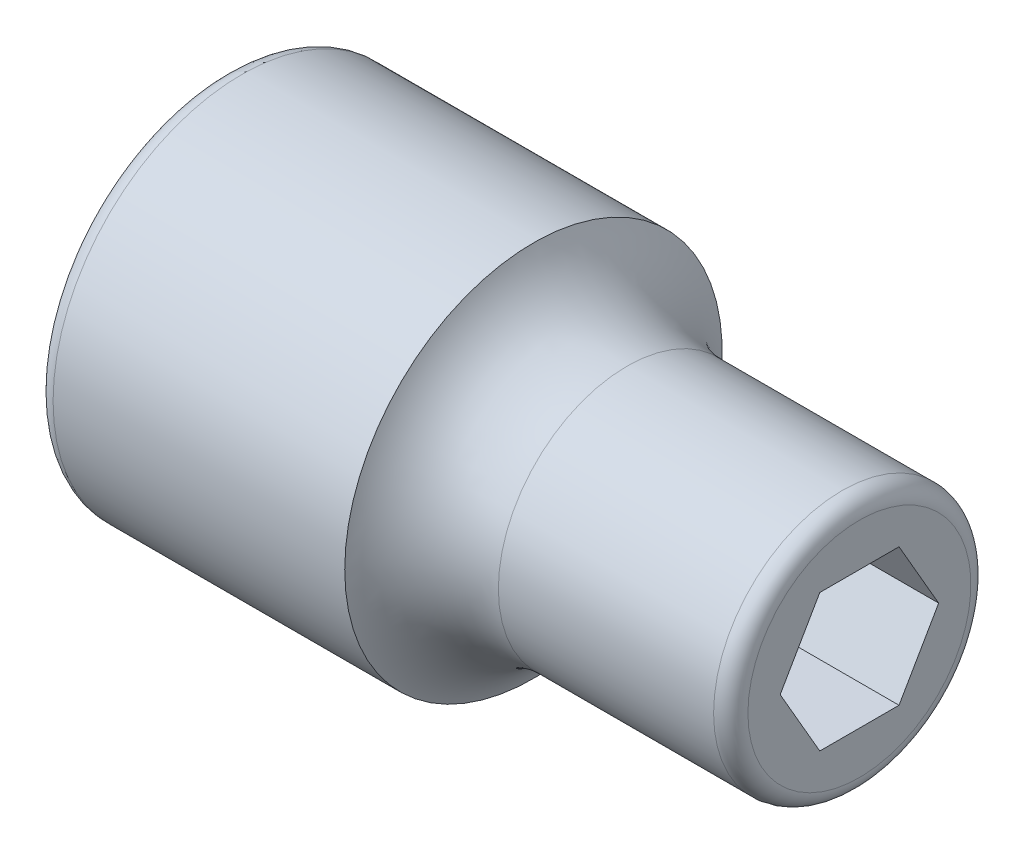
from build123d import *

# Parameters (mm, degrees)
ENL_V_MAT_EXTRU_1_DEPTH = 18
ENL_V_MAT_EXTRU_2_DEPTH = 9


with BuildPart() as part:
    # Esquisse1 → Base-R_volution (revolve)
    with BuildSketch(Plane.XY, mode=Mode.PRIVATE) as base_r_volution_sk:
        with BuildLine():
            Line((-26.556624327, 6.5), (-28, 9))
            Line((-28, 9), (-28, 10))
            ThreePointArc((-28, 10), (-27.707106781, 10.707106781), (-27, 11))
            Line((-27, 11), (-10, 11))
            ThreePointArc((-10, 11), (-7.786014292, 8.450247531), (-4.545643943, 7.5))
            Line((-4.545643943, 7.5), (8, 7.5))
            ThreePointArc((8, 7.5), (8.707106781, 7.207106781), (9, 6.5))
            Line((9, 6.5), (9, 3.9))
            Line((9, 3.9), (0, 3.9))
            Line((0, 3.9), (0, 3))
            Line((0, 3), (-9, 3))
            Line((-9, 3), (-10, 6.5))
            Line((-10, 6.5), (-26.556624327, 6.5))
        make_face()
    revolve(base_r_volution_sk.sketch.rotate(Axis((0, 0, 0), (1, 0, 0)), 90), axis=Axis((0, 0, 0), (1, 0, 0)))

    # Esquisse2 → Enl_v. mat.-Extru.1 (cut)
    with BuildSketch(Plane.ZY.offset(28)):
        with BuildLine():
            Line((-5.5, 6.5), (5.5, 6.5))
            ThreePointArc((5.5, 6.5), (6.207106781, 6.207106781), (6.5, 5.5))
            Line((6.5, 5.5), (6.5, -5.5))
            ThreePointArc((6.5, -5.5), (6.207106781, -6.207106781), (5.5, -6.5))
            Line((5.5, -6.5), (-5.5, -6.5))
            ThreePointArc((-5.5, -6.5), (-6.207106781, -6.207106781), (-6.5, -5.5))
            Line((-6.5, -5.5), (-6.5, 5.5))
            ThreePointArc((-6.5, 5.5), (-6.207106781, 6.207106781), (-5.5, 6.5))
        make_face()
    extrude(amount=-ENL_V_MAT_EXTRU_1_DEPTH, mode=Mode.SUBTRACT)

    # Esquisse3 → Enl_v. mat.-Extru.2 (cut)
    with BuildSketch(Plane(origin=(9, 0, 0), x_dir=(0, 0, -1), z_dir=(1, 0, 0))):
        Polygon((-4.618802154, 0), (-2.309401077, -4), (2.309401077, -4), (4.618802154, 0), (2.309401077, 4), (-2.309401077, 4), align=None)
    extrude(amount=-ENL_V_MAT_EXTRU_2_DEPTH, mode=Mode.SUBTRACT)


solid = part.part
